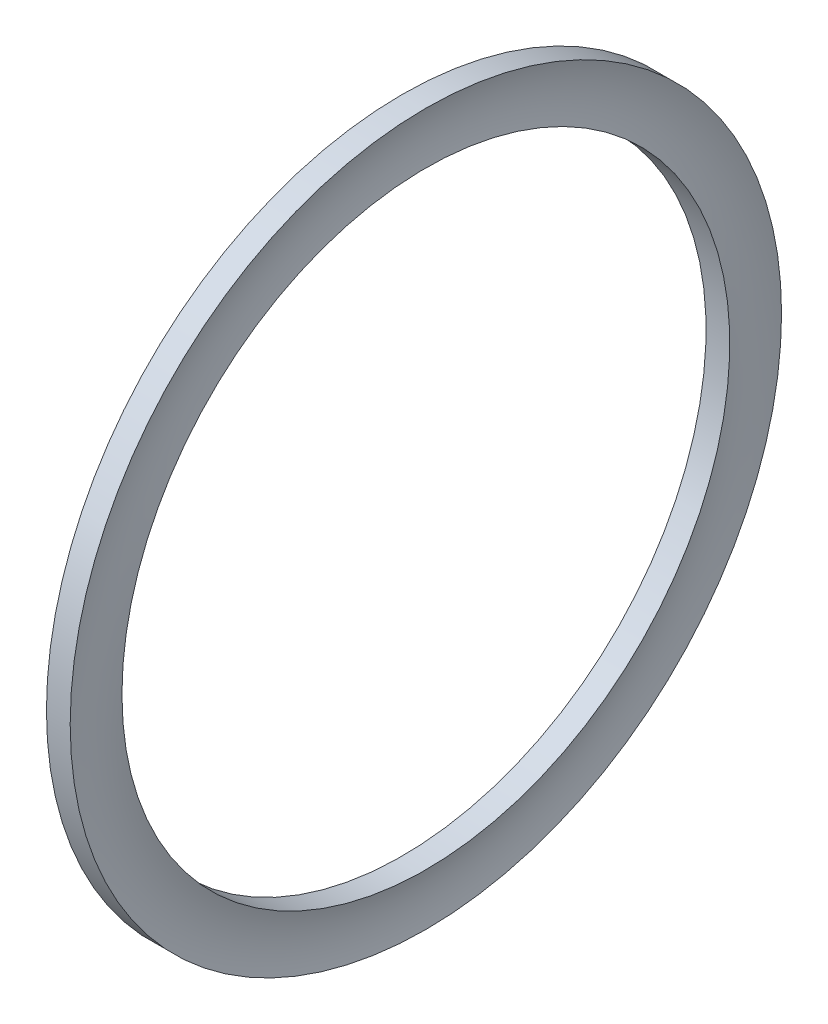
ISO-10303-21;
HEADER;
FILE_DESCRIPTION(('STEP AP214'),'2;1');
FILE_NAME('part.step','',(''),(''),'','','');
FILE_SCHEMA(('AUTOMOTIVE_DESIGN { 1 0 10303 214 1 1 1 1 }'));
ENDSEC;
DATA;
#1=APPLICATION_CONTEXT('core data for automotive mechanical design processes');
#2=APPLICATION_PROTOCOL_DEFINITION('international standard','automotive_design',2000,#1);
#3=PRODUCT_CONTEXT('',#1,'mechanical');
#4=PRODUCT('Part','Part','',(#3));
#5=PRODUCT_RELATED_PRODUCT_CATEGORY('part','',(#4));
#6=PRODUCT_DEFINITION_FORMATION('','',#4);
#7=PRODUCT_DEFINITION_CONTEXT('part definition',#1,'design');
#8=PRODUCT_DEFINITION('design','',#6,#7);
#9=PRODUCT_DEFINITION_SHAPE('','',#8);
#10=(LENGTH_UNIT() NAMED_UNIT(*) SI_UNIT(.MILLI.,.METRE.));
#11=(NAMED_UNIT(*) PLANE_ANGLE_UNIT() SI_UNIT($,.RADIAN.));
#12=(NAMED_UNIT(*) SI_UNIT($,.STERADIAN.) SOLID_ANGLE_UNIT());
#13=UNCERTAINTY_MEASURE_WITH_UNIT(LENGTH_MEASURE(1.E-05),#10,'distance_accuracy_value','');
#14=(GEOMETRIC_REPRESENTATION_CONTEXT(3) GLOBAL_UNCERTAINTY_ASSIGNED_CONTEXT((#13)) GLOBAL_UNIT_ASSIGNED_CONTEXT((#10,
#11,#12)) REPRESENTATION_CONTEXT('',''));
#15=CARTESIAN_POINT('',(0.,0.,0.));
#16=DIRECTION('',(0.,0.,1.));
#17=DIRECTION('',(1.,0.,0.));
#18=AXIS2_PLACEMENT_3D('',#15,#16,#17);
#19=CARTESIAN_POINT('',(0.,16.2560000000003,0.));
#20=DIRECTION('',(1.,0.,0.));
#21=DIRECTION('',(0.,0.,-1.00000000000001));
#22=AXIS2_PLACEMENT_3D('',#19,#20,#21);
#23=PLANE('',#22);
#24=CARTESIAN_POINT('',(0.,0.,0.));
#25=DIRECTION('',(-1.,0.,0.));
#26=DIRECTION('',(0.,0.,1.00000000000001));
#27=AXIS2_PLACEMENT_3D('',#24,#25,#26);
#28=CIRCLE('',#27,16.256);
#29=CARTESIAN_POINT('',(-1.00987555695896E-13,-2.33267627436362E-13,16.2560000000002));
#30=VERTEX_POINT('',#29);
#31=EDGE_CURVE('E10',#30,#30,#28,.T.);
#32=ORIENTED_EDGE('',*,*,#31,.F.);
#33=EDGE_LOOP('',(#32));
#34=FACE_BOUND('',#33,.T.);
#35=CARTESIAN_POINT('',(0.,0.,0.));
#36=DIRECTION('',(-1.,0.,0.));
#37=DIRECTION('',(0.,0.,1.00000000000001));
#38=AXIS2_PLACEMENT_3D('',#35,#36,#37);
#39=CIRCLE('',#38,19.0246);
#40=CARTESIAN_POINT('',(-1.18186998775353E-13,-2.72996020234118E-13,19.0246000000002));
#41=VERTEX_POINT('',#40);
#42=EDGE_CURVE('E395',#41,#41,#39,.T.);
#43=ORIENTED_EDGE('',*,*,#42,.T.);
#44=EDGE_LOOP('',(#43));
#45=FACE_BOUND('',#44,.T.);
#46=ADVANCED_FACE('F381',(#34,#45),#23,.F.);
#47=CARTESIAN_POINT('',(0.,0.,0.));
#48=DIRECTION('',(-1.,0.,0.));
#49=DIRECTION('',(0.,0.,1.00000000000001));
#50=AXIS2_PLACEMENT_3D('',#47,#48,#49);
#51=CYLINDRICAL_SURFACE('',#50,16.256);
#52=CARTESIAN_POINT('',(1.2700000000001,0.,0.));
#53=DIRECTION('',(-1.,0.,0.));
#54=DIRECTION('',(0.,0.,1.00000000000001));
#55=AXIS2_PLACEMENT_3D('',#52,#53,#54);
#56=CIRCLE('',#55,16.256);
#57=CARTESIAN_POINT('',(1.27,-2.3413498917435E-13,16.2560000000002));
#58=VERTEX_POINT('',#57);
#59=EDGE_CURVE('E387',#58,#58,#56,.T.);
#60=ORIENTED_EDGE('',*,*,#59,.F.);
#61=EDGE_LOOP('',(#60));
#62=FACE_BOUND('',#61,.T.);
#63=ORIENTED_EDGE('',*,*,#31,.T.);
#64=EDGE_LOOP('',(#63));
#65=FACE_BOUND('',#64,.T.);
#66=ADVANCED_FACE('F410',(#62,#65),#51,.F.);
#67=CARTESIAN_POINT('',(5.46721070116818,0.,-9.15933995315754E-13));
#68=DIRECTION('',(-1.,0.,0.));
#69=DIRECTION('',(0.,0.,1.00000000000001));
#70=AXIS2_PLACEMENT_3D('',#67,#68,#69);
#71=TOROIDAL_SURFACE('',#70,17.6403,4.4196);
#72=CARTESIAN_POINT('',(1.2700000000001,0.,0.));
#73=DIRECTION('',(-1.,0.,0.));
#74=DIRECTION('',(0.,0.,1.00000000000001));
#75=AXIS2_PLACEMENT_3D('',#72,#73,#74);
#76=CIRCLE('',#75,19.0246);
#77=CARTESIAN_POINT('',(1.26999999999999,-2.73863381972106E-13,19.0246000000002));
#78=VERTEX_POINT('',#77);
#79=EDGE_CURVE('E391',#78,#78,#76,.T.);
#80=ORIENTED_EDGE('',*,*,#79,.F.);
#81=EDGE_LOOP('',(#80));
#82=FACE_BOUND('',#81,.T.);
#83=ORIENTED_EDGE('',*,*,#59,.T.);
#84=EDGE_LOOP('',(#83));
#85=FACE_BOUND('',#84,.T.);
#86=ADVANCED_FACE('F405',(#82,#85),#71,.F.);
#87=CARTESIAN_POINT('',(0.,0.,0.));
#88=DIRECTION('',(-1.,0.,0.));
#89=DIRECTION('',(0.,0.,1.00000000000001));
#90=AXIS2_PLACEMENT_3D('',#87,#88,#89);
#91=CYLINDRICAL_SURFACE('',#90,19.0246);
#92=ORIENTED_EDGE('',*,*,#42,.F.);
#93=EDGE_LOOP('',(#92));
#94=FACE_BOUND('',#93,.T.);
#95=ORIENTED_EDGE('',*,*,#79,.T.);
#96=EDGE_LOOP('',(#95));
#97=FACE_BOUND('',#96,.T.);
#98=ADVANCED_FACE('F402',(#94,#97),#91,.T.);
#99=CLOSED_SHELL('',(#46,#66,#86,#98));
#100=MANIFOLD_SOLID_BREP('B2',#99);
#101=ADVANCED_BREP_SHAPE_REPRESENTATION('',(#18,#100),#14);
#102=SHAPE_DEFINITION_REPRESENTATION(#9,#101);
ENDSEC;
END-ISO-10303-21;
